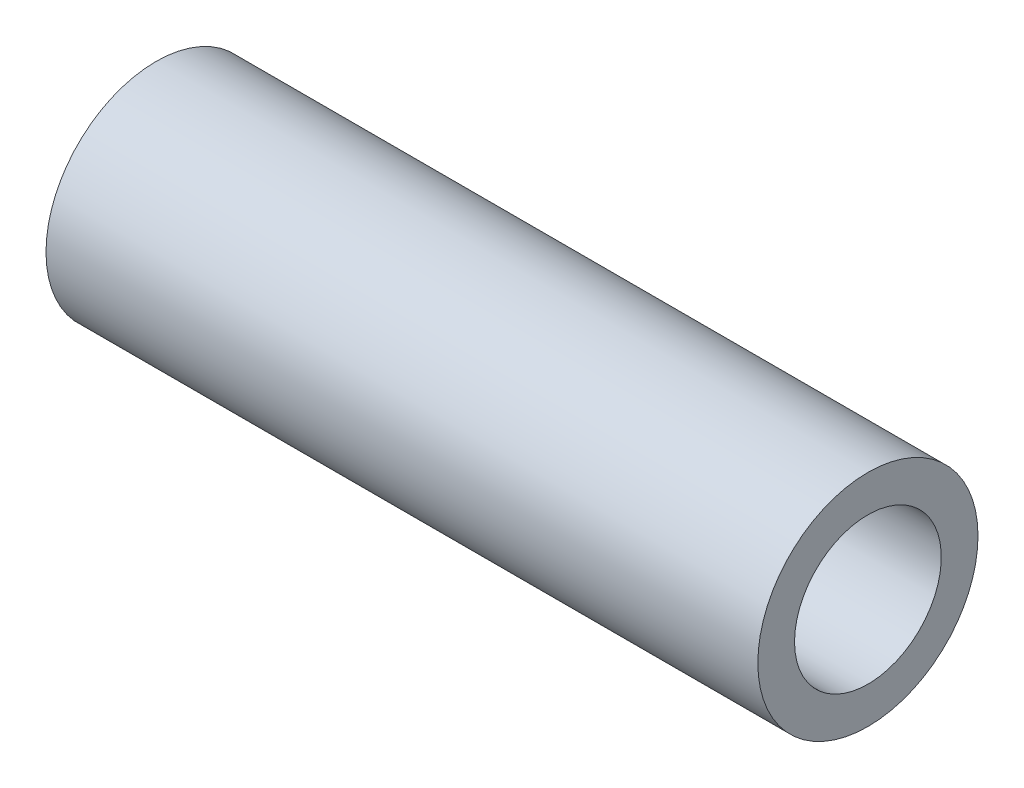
ISO-10303-21;
HEADER;
FILE_DESCRIPTION(('STEP AP214'),'2;1');
FILE_NAME('part.step','',(''),(''),'','','');
FILE_SCHEMA(('AUTOMOTIVE_DESIGN { 1 0 10303 214 1 1 1 1 }'));
ENDSEC;
DATA;
#1=APPLICATION_CONTEXT('core data for automotive mechanical design processes');
#2=APPLICATION_PROTOCOL_DEFINITION('international standard','automotive_design',2000,#1);
#3=PRODUCT_CONTEXT('',#1,'mechanical');
#4=PRODUCT('Part','Part','',(#3));
#5=PRODUCT_RELATED_PRODUCT_CATEGORY('part','',(#4));
#6=PRODUCT_DEFINITION_FORMATION('','',#4);
#7=PRODUCT_DEFINITION_CONTEXT('part definition',#1,'design');
#8=PRODUCT_DEFINITION('design','',#6,#7);
#9=PRODUCT_DEFINITION_SHAPE('','',#8);
#10=(LENGTH_UNIT() NAMED_UNIT(*) SI_UNIT(.MILLI.,.METRE.));
#11=(NAMED_UNIT(*) PLANE_ANGLE_UNIT() SI_UNIT($,.RADIAN.));
#12=(NAMED_UNIT(*) SI_UNIT($,.STERADIAN.) SOLID_ANGLE_UNIT());
#13=UNCERTAINTY_MEASURE_WITH_UNIT(LENGTH_MEASURE(1.E-05),#10,'distance_accuracy_value','');
#14=(GEOMETRIC_REPRESENTATION_CONTEXT(3) GLOBAL_UNCERTAINTY_ASSIGNED_CONTEXT((#13)) GLOBAL_UNIT_ASSIGNED_CONTEXT((#10,
#11,#12)) REPRESENTATION_CONTEXT('',''));
#15=CARTESIAN_POINT('',(0.,0.,0.));
#16=DIRECTION('',(0.,0.,1.));
#17=DIRECTION('',(1.,0.,0.));
#18=AXIS2_PLACEMENT_3D('',#15,#16,#17);
#19=CARTESIAN_POINT('',(-25.5720184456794,0.,0.));
#20=DIRECTION('',(-1.,0.,0.));
#21=DIRECTION('',(0.,0.,1.));
#22=AXIS2_PLACEMENT_3D('',#19,#20,#21);
#23=CYLINDRICAL_SURFACE('',#22,7.5);
#24=CARTESIAN_POINT('',(-18.3801768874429,0.,0.));
#25=DIRECTION('',(-1.,0.,0.));
#26=DIRECTION('',(0.,0.,1.));
#27=AXIS2_PLACEMENT_3D('',#24,#25,#26);
#28=CIRCLE('',#27,7.5);
#29=CARTESIAN_POINT('',(-18.3801768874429,0.,7.5));
#30=VERTEX_POINT('',#29);
#31=EDGE_CURVE('E54',#30,#30,#28,.T.);
#32=ORIENTED_EDGE('',*,*,#31,.F.);
#33=EDGE_LOOP('',(#32));
#34=FACE_BOUND('',#33,.T.);
#35=CARTESIAN_POINT('',(30.1198231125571,0.,0.));
#36=DIRECTION('',(-1.,0.,0.));
#37=DIRECTION('',(0.,0.,1.));
#38=AXIS2_PLACEMENT_3D('',#35,#36,#37);
#39=CIRCLE('',#38,7.5);
#40=CARTESIAN_POINT('',(30.1198231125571,0.,7.5));
#41=VERTEX_POINT('',#40);
#42=EDGE_CURVE('E10',#41,#41,#39,.T.);
#43=ORIENTED_EDGE('',*,*,#42,.T.);
#44=EDGE_LOOP('',(#43));
#45=FACE_BOUND('',#44,.T.);
#46=ADVANCED_FACE('F37',(#34,#45),#23,.T.);
#47=CARTESIAN_POINT('',(30.1198231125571,7.5,0.));
#48=DIRECTION('',(-1.,0.,0.));
#49=DIRECTION('',(0.,0.,1.));
#50=AXIS2_PLACEMENT_3D('',#47,#48,#49);
#51=PLANE('',#50);
#52=ORIENTED_EDGE('',*,*,#42,.F.);
#53=EDGE_LOOP('',(#52));
#54=FACE_BOUND('',#53,.T.);
#55=CARTESIAN_POINT('',(30.1198231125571,0.,0.));
#56=DIRECTION('',(-1.,0.,0.));
#57=DIRECTION('',(0.,0.,1.));
#58=AXIS2_PLACEMENT_3D('',#55,#56,#57);
#59=CIRCLE('',#58,5.);
#60=CARTESIAN_POINT('',(30.1198231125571,0.,5.));
#61=VERTEX_POINT('',#60);
#62=EDGE_CURVE('E44',#61,#61,#59,.T.);
#63=ORIENTED_EDGE('',*,*,#62,.T.);
#64=EDGE_LOOP('',(#63));
#65=FACE_BOUND('',#64,.T.);
#66=ADVANCED_FACE('F64',(#54,#65),#51,.F.);
#67=CARTESIAN_POINT('',(-25.5720184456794,0.,0.));
#68=DIRECTION('',(-1.,0.,0.));
#69=DIRECTION('',(0.,0.,1.));
#70=AXIS2_PLACEMENT_3D('',#67,#68,#69);
#71=CYLINDRICAL_SURFACE('',#70,5.);
#72=ORIENTED_EDGE('',*,*,#62,.F.);
#73=EDGE_LOOP('',(#72));
#74=FACE_BOUND('',#73,.T.);
#75=CARTESIAN_POINT('',(-18.3801768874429,0.,0.));
#76=DIRECTION('',(-1.,0.,0.));
#77=DIRECTION('',(0.,0.,1.));
#78=AXIS2_PLACEMENT_3D('',#75,#76,#77);
#79=CIRCLE('',#78,5.);
#80=CARTESIAN_POINT('',(-18.3801768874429,0.,5.));
#81=VERTEX_POINT('',#80);
#82=EDGE_CURVE('E49',#81,#81,#79,.T.);
#83=ORIENTED_EDGE('',*,*,#82,.T.);
#84=EDGE_LOOP('',(#83));
#85=FACE_BOUND('',#84,.T.);
#86=ADVANCED_FACE('F68',(#74,#85),#71,.F.);
#87=CARTESIAN_POINT('',(-18.3801768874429,5.,0.));
#88=DIRECTION('',(1.,0.,0.));
#89=DIRECTION('',(0.,0.,-1.));
#90=AXIS2_PLACEMENT_3D('',#87,#88,#89);
#91=PLANE('',#90);
#92=ORIENTED_EDGE('',*,*,#82,.F.);
#93=EDGE_LOOP('',(#92));
#94=FACE_BOUND('',#93,.T.);
#95=ORIENTED_EDGE('',*,*,#31,.T.);
#96=EDGE_LOOP('',(#95));
#97=FACE_BOUND('',#96,.T.);
#98=ADVANCED_FACE('F61',(#94,#97),#91,.F.);
#99=CLOSED_SHELL('',(#46,#66,#86,#98));
#100=MANIFOLD_SOLID_BREP('B2',#99);
#101=ADVANCED_BREP_SHAPE_REPRESENTATION('',(#18,#100),#14);
#102=SHAPE_DEFINITION_REPRESENTATION(#9,#101);
ENDSEC;
END-ISO-10303-21;
